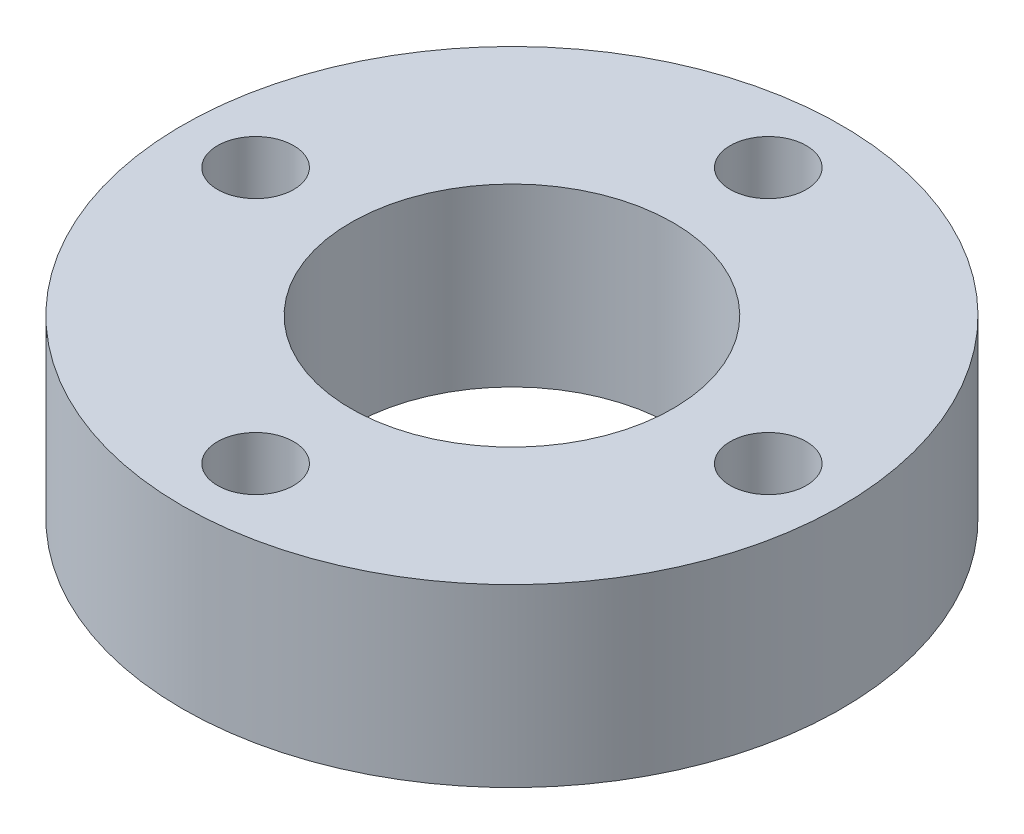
from build123d import *

# Parameters (mm, degrees)
SKETCH_1_R          = 22.5
EXTRUDE_1_DEPTH     = 12
SKETCH_2_R          = 4.2
CUT_EXTRUDE_1_DEPTH = 4.4
SKETCH_3_R          = 2.6
CUT_EXTRUDE_2_DEPTH = 35.007352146
SKETCH_4_R          = 4
CUT_EXTRUDE_3_DEPTH = 35.007352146
SKETCH_5_R          = 11
CUT_EXTRUDE_4_DEPTH = 35.007352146


with BuildPart() as part:
    # Sketch 1 → Extrude 1 (new body)
    with BuildSketch(Plane(origin=(0, 0, 0), x_dir=(1, 0, 0), z_dir=(0, 1, 0))):
        with Locations(Location((0, 0, 0), (0, 0, 270))):
            Circle(SKETCH_1_R)
    extrude(amount=EXTRUDE_1_DEPTH)

    # Sketch 2 → Cut-Extrude 1 (cut)
    with BuildSketch(Plane.XZ):
        with Locations(Location((17.5, 0, 0), (0, 0, 270))):
            Circle(SKETCH_2_R)
        with Locations(Location((0, 17.5, 0), (0, 0, 270))):
            Circle(SKETCH_2_R)
        with Locations(Location((-17.5, 0, 0), (0, 0, 270))):
            Circle(SKETCH_2_R)
        with Locations(Location((0, -17.5, 0), (0, 0, 270))):
            Circle(SKETCH_2_R)
    extrude(amount=-CUT_EXTRUDE_1_DEPTH, mode=Mode.SUBTRACT)

    # Sketch 3 → Cut-Extrude 2 (cut, through all)
    with BuildSketch(Plane.XZ):
        with Locations(Location((0, 17.5, 0), (0, 0, 270))):
            Circle(SKETCH_3_R)
        with Locations(Location((17.5, 0, 0), (0, 0, 270))):
            Circle(SKETCH_3_R)
        with Locations(Location((0, -17.5, 0), (0, 0, 270))):
            Circle(SKETCH_3_R)
        with Locations(Location((-17.5, 0, 0), (0, 0, 270))):
            Circle(SKETCH_3_R)
    extrude(amount=-CUT_EXTRUDE_2_DEPTH, mode=Mode.SUBTRACT)

    # Sketch 4 → Cut-Extrude 3 (cut, through all)
    with BuildSketch(Plane.XZ):
        with Locations(Location((0, 0, 0), (0, 0, 270))):
            Circle(SKETCH_4_R)
    extrude(amount=-CUT_EXTRUDE_3_DEPTH, mode=Mode.SUBTRACT)

    # Sketch 5 → Cut-Extrude 4 (cut, through all)
    with BuildSketch(Plane.XZ):
        with Locations(Location((0, 0, 0), (0, 0, 270))):
            Circle(SKETCH_5_R)
    extrude(amount=-CUT_EXTRUDE_4_DEPTH, mode=Mode.SUBTRACT)


solid = part.part
